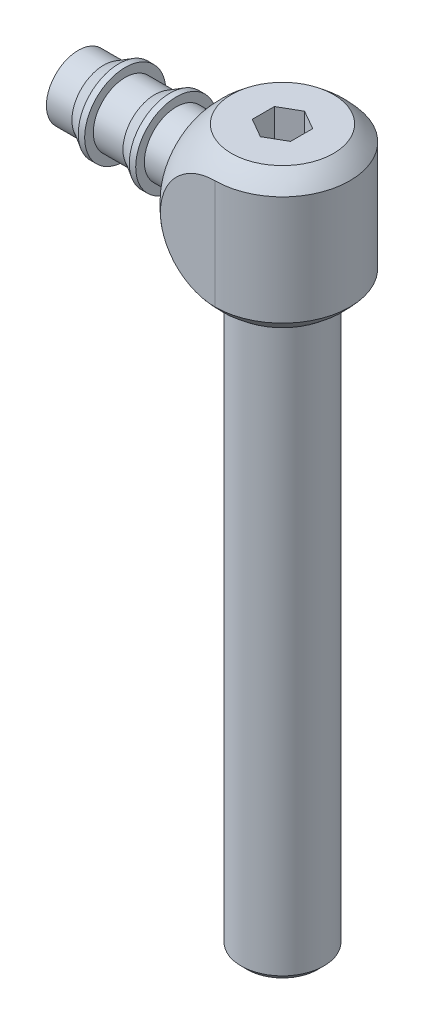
ISO-10303-21;
HEADER;
FILE_DESCRIPTION(('STEP AP214'),'2;1');
FILE_NAME('part.step','',(''),(''),'','','');
FILE_SCHEMA(('AUTOMOTIVE_DESIGN { 1 0 10303 214 1 1 1 1 }'));
ENDSEC;
DATA;
#1=APPLICATION_CONTEXT('core data for automotive mechanical design processes');
#2=APPLICATION_PROTOCOL_DEFINITION('international standard','automotive_design',2000,#1);
#3=PRODUCT_CONTEXT('',#1,'mechanical');
#4=PRODUCT('Part','Part','',(#3));
#5=PRODUCT_RELATED_PRODUCT_CATEGORY('part','',(#4));
#6=PRODUCT_DEFINITION_FORMATION('','',#4);
#7=PRODUCT_DEFINITION_CONTEXT('part definition',#1,'design');
#8=PRODUCT_DEFINITION('design','',#6,#7);
#9=PRODUCT_DEFINITION_SHAPE('','',#8);
#10=(LENGTH_UNIT() NAMED_UNIT(*) SI_UNIT(.MILLI.,.METRE.));
#11=(NAMED_UNIT(*) PLANE_ANGLE_UNIT() SI_UNIT($,.RADIAN.));
#12=(NAMED_UNIT(*) SI_UNIT($,.STERADIAN.) SOLID_ANGLE_UNIT());
#13=UNCERTAINTY_MEASURE_WITH_UNIT(LENGTH_MEASURE(1.E-05),#10,'distance_accuracy_value','');
#14=(GEOMETRIC_REPRESENTATION_CONTEXT(3) GLOBAL_UNCERTAINTY_ASSIGNED_CONTEXT((#13)) GLOBAL_UNIT_ASSIGNED_CONTEXT((#10,
#11,#12)) REPRESENTATION_CONTEXT('',''));
#15=CARTESIAN_POINT('',(0.,0.,0.));
#16=DIRECTION('',(0.,0.,1.));
#17=DIRECTION('',(1.,0.,0.));
#18=AXIS2_PLACEMENT_3D('',#15,#16,#17);
#19=CARTESIAN_POINT('',(-12.7,5.9944,-8.382));
#20=DIRECTION('',(0.,-1.,0.));
#21=DIRECTION('',(0.,0.,-1.));
#22=AXIS2_PLACEMENT_3D('',#19,#20,#21);
#23=PLANE('',#22);
#24=CARTESIAN_POINT('',(0.,5.9944,0.));
#25=DIRECTION('',(0.,-1.,0.));
#26=DIRECTION('',(0.,0.,-1.));
#27=AXIS2_PLACEMENT_3D('',#24,#25,#26);
#28=CIRCLE('',#27,6.34801531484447);
#29=CARTESIAN_POINT('',(0.,5.9944,-6.34801531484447));
#30=VERTEX_POINT('',#29);
#31=EDGE_CURVE('E206',#30,#30,#28,.F.);
#32=ORIENTED_EDGE('',*,*,#31,.F.);
#33=EDGE_LOOP('',(#32));
#34=FACE_BOUND('',#33,.T.);
#35=CARTESIAN_POINT('',(0.,5.9944,0.));
#36=DIRECTION('',(0.,1.,0.));
#37=DIRECTION('',(-1.,0.,0.));
#38=AXIS2_PLACEMENT_3D('',#35,#36,#37);
#39=CIRCLE('',#38,5.1435);
#40=CARTESIAN_POINT('',(-5.1435,5.9944,0.));
#41=VERTEX_POINT('',#40);
#42=EDGE_CURVE('E170',#41,#41,#39,.T.);
#43=ORIENTED_EDGE('',*,*,#42,.T.);
#44=EDGE_LOOP('',(#43));
#45=FACE_BOUND('',#44,.T.);
#46=ADVANCED_FACE('F38',(#34,#45),#23,.T.);
#47=CARTESIAN_POINT('',(-8.382,3.93065,8.382));
#48=DIRECTION('',(1.,0.,0.));
#49=DIRECTION('',(0.,0.,-1.));
#50=AXIS2_PLACEMENT_3D('',#47,#48,#49);
#51=PLANE('',#50);
#52=CARTESIAN_POINT('',(-8.382,14.72565,0.));
#53=DIRECTION('',(1.,0.,0.));
#54=DIRECTION('',(0.,0.,-1.));
#55=AXIS2_PLACEMENT_3D('',#52,#53,#54);
#56=CIRCLE('',#55,4.7625);
#57=CARTESIAN_POINT('',(-8.382,14.72565,-4.7625));
#58=VERTEX_POINT('',#57);
#59=EDGE_CURVE('E12',#58,#58,#56,.T.);
#60=ORIENTED_EDGE('',*,*,#59,.T.);
#61=EDGE_LOOP('',(#60));
#62=FACE_BOUND('',#61,.T.);
#63=CARTESIAN_POINT('',(-8.382,14.72565,0.));
#64=DIRECTION('',(1.,0.,0.));
#65=DIRECTION('',(0.,0.,-1.));
#66=AXIS2_PLACEMENT_3D('',#63,#64,#65);
#67=CIRCLE('',#66,6.80250696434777);
#68=CARTESIAN_POINT('',(-8.382,14.72565,-6.80250696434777));
#69=VERTEX_POINT('',#68);
#70=EDGE_CURVE('E214',#69,#69,#67,.F.);
#71=ORIENTED_EDGE('',*,*,#70,.T.);
#72=EDGE_LOOP('',(#71));
#73=FACE_BOUND('',#72,.T.);
#74=ADVANCED_FACE('F250',(#62,#73),#51,.F.);
#75=CARTESIAN_POINT('',(0.,14.72565,0.));
#76=DIRECTION('',(0.,-1.,0.));
#77=DIRECTION('',(1.,0.,0.));
#78=AXIS2_PLACEMENT_3D('',#75,#76,#77);
#79=SPHERICAL_SURFACE('',#78,10.795);
#80=ORIENTED_EDGE('',*,*,#31,.T.);
#81=EDGE_LOOP('',(#80));
#82=FACE_BOUND('',#81,.T.);
#83=ORIENTED_EDGE('',*,*,#70,.F.);
#84=EDGE_LOOP('',(#83));
#85=FACE_BOUND('',#84,.T.);
#86=CARTESIAN_POINT('',(0.,14.72565,-8.382));
#87=DIRECTION('',(0.,0.,1.));
#88=DIRECTION('',(1.,0.,0.));
#89=AXIS2_PLACEMENT_3D('',#86,#87,#88);
#90=CIRCLE('',#89,6.80250696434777);
#91=CARTESIAN_POINT('',(0.,7.92314303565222,-8.382));
#92=VERTEX_POINT('',#91);
#93=CARTESIAN_POINT('',(0.,21.5281569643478,-8.382));
#94=VERTEX_POINT('',#93);
#95=EDGE_CURVE('E222',#92,#94,#90,.F.);
#96=ORIENTED_EDGE('',*,*,#95,.F.);
#97=CARTESIAN_POINT('',(0.,7.92314303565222,0.));
#98=DIRECTION('',(0.,1.,0.));
#99=DIRECTION('',(0.,0.,1.));
#100=AXIS2_PLACEMENT_3D('',#97,#98,#99);
#101=CIRCLE('',#100,8.382);
#102=CARTESIAN_POINT('',(0.,7.92314303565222,8.382));
#103=VERTEX_POINT('',#102);
#104=EDGE_CURVE('E220',#103,#92,#101,.T.);
#105=ORIENTED_EDGE('',*,*,#104,.F.);
#106=CARTESIAN_POINT('',(0.,14.72565,8.382));
#107=DIRECTION('',(0.,0.,-1.));
#108=DIRECTION('',(-1.,0.,0.));
#109=AXIS2_PLACEMENT_3D('',#106,#107,#108);
#110=CIRCLE('',#109,6.80250696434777);
#111=CARTESIAN_POINT('',(0.,21.5281569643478,8.382));
#112=VERTEX_POINT('',#111);
#113=EDGE_CURVE('E215',#112,#103,#110,.F.);
#114=ORIENTED_EDGE('',*,*,#113,.F.);
#115=CARTESIAN_POINT('',(0.,21.5281569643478,0.));
#116=DIRECTION('',(0.,-1.,0.));
#117=DIRECTION('',(0.,0.,-1.));
#118=AXIS2_PLACEMENT_3D('',#115,#116,#117);
#119=CIRCLE('',#118,8.382);
#120=EDGE_CURVE('E217',#94,#112,#119,.T.);
#121=ORIENTED_EDGE('',*,*,#120,.F.);
#122=EDGE_LOOP('',(#96,#105,#114,#121));
#123=FACE_BOUND('',#122,.T.);
#124=CARTESIAN_POINT('',(0.,23.4569,0.));
#125=DIRECTION('',(0.,1.,0.));
#126=DIRECTION('',(0.,0.,1.));
#127=AXIS2_PLACEMENT_3D('',#124,#125,#126);
#128=CIRCLE('',#127,6.34801531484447);
#129=CARTESIAN_POINT('',(0.,23.4569,6.34801531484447));
#130=VERTEX_POINT('',#129);
#131=EDGE_CURVE('E211',#130,#130,#128,.F.);
#132=ORIENTED_EDGE('',*,*,#131,.T.);
#133=EDGE_LOOP('',(#132));
#134=FACE_BOUND('',#133,.T.);
#135=ADVANCED_FACE('F256',(#82,#85,#123,#134),#79,.T.);
#136=CARTESIAN_POINT('',(0.,3.93065,-8.382));
#137=DIRECTION('',(0.,0.,1.));
#138=DIRECTION('',(1.,0.,0.));
#139=AXIS2_PLACEMENT_3D('',#136,#137,#138);
#140=PLANE('',#139);
#141=ORIENTED_EDGE('',*,*,#95,.T.);
#142=DIRECTION('',(0.,-1.,0.));
#143=VECTOR('',#142,1.);
#144=CARTESIAN_POINT('',(0.,3.93065,-8.382));
#145=LINE('',#144,#143);
#146=EDGE_CURVE('E210',#94,#92,#145,.T.);
#147=ORIENTED_EDGE('',*,*,#146,.T.);
#148=EDGE_LOOP('',(#141,#147));
#149=FACE_BOUND('',#148,.T.);
#150=ADVANCED_FACE('F268',(#149),#140,.F.);
#151=CARTESIAN_POINT('',(0.,3.93065,8.382));
#152=DIRECTION('',(0.,0.,-1.));
#153=DIRECTION('',(-1.,0.,0.));
#154=AXIS2_PLACEMENT_3D('',#151,#152,#153);
#155=PLANE('',#154);
#156=ORIENTED_EDGE('',*,*,#113,.T.);
#157=DIRECTION('',(0.,-1.,0.));
#158=VECTOR('',#157,1.);
#159=CARTESIAN_POINT('',(0.,3.93065,8.382));
#160=LINE('',#159,#158);
#161=EDGE_CURVE('E207',#112,#103,#160,.T.);
#162=ORIENTED_EDGE('',*,*,#161,.F.);
#163=EDGE_LOOP('',(#156,#162));
#164=FACE_BOUND('',#163,.T.);
#165=ADVANCED_FACE('F265',(#164),#155,.F.);
#166=CARTESIAN_POINT('',(0.,3.93065,0.));
#167=DIRECTION('',(0.,-1.,0.));
#168=DIRECTION('',(0.,0.,-1.));
#169=AXIS2_PLACEMENT_3D('',#166,#167,#168);
#170=CYLINDRICAL_SURFACE('',#169,8.382);
#171=ORIENTED_EDGE('',*,*,#104,.T.);
#172=ORIENTED_EDGE('',*,*,#146,.F.);
#173=ORIENTED_EDGE('',*,*,#120,.T.);
#174=ORIENTED_EDGE('',*,*,#161,.T.);
#175=EDGE_LOOP('',(#171,#172,#173,#174));
#176=FACE_BOUND('',#175,.T.);
#177=ADVANCED_FACE('F267',(#176),#170,.T.);
#178=CARTESIAN_POINT('',(-12.7,23.4569,-8.382));
#179=DIRECTION('',(0.,1.,0.));
#180=DIRECTION('',(0.,0.,1.));
#181=AXIS2_PLACEMENT_3D('',#178,#179,#180);
#182=PLANE('',#181);
#183=DIRECTION('',(0.866025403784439,0.,0.5));
#184=VECTOR('',#183,1.);
#185=CARTESIAN_POINT('',(-2.38125,23.4569,1.3748153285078));
#186=LINE('',#185,#184);
#187=CARTESIAN_POINT('',(-2.38125,23.4569,1.3748153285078));
#188=VERTEX_POINT('',#187);
#189=CARTESIAN_POINT('',(0.,23.4569,2.74963065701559));
#190=VERTEX_POINT('',#189);
#191=EDGE_CURVE('E59',#188,#190,#186,.T.);
#192=ORIENTED_EDGE('',*,*,#191,.F.);
#193=DIRECTION('',(0.,0.,1.));
#194=VECTOR('',#193,1.);
#195=CARTESIAN_POINT('',(-2.38125,23.4569,-1.3748153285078));
#196=LINE('',#195,#194);
#197=CARTESIAN_POINT('',(-2.38125,23.4569,-1.3748153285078));
#198=VERTEX_POINT('',#197);
#199=EDGE_CURVE('E127',#198,#188,#196,.T.);
#200=ORIENTED_EDGE('',*,*,#199,.F.);
#201=DIRECTION('',(-0.866025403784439,0.,0.5));
#202=VECTOR('',#201,1.);
#203=CARTESIAN_POINT('',(0.,23.4569,-2.74963065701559));
#204=LINE('',#203,#202);
#205=CARTESIAN_POINT('',(0.,23.4569,-2.74963065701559));
#206=VERTEX_POINT('',#205);
#207=EDGE_CURVE('E130',#206,#198,#204,.T.);
#208=ORIENTED_EDGE('',*,*,#207,.F.);
#209=DIRECTION('',(-0.866025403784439,0.,-0.5));
#210=VECTOR('',#209,1.);
#211=CARTESIAN_POINT('',(2.38125,23.4569,-1.3748153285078));
#212=LINE('',#211,#210);
#213=CARTESIAN_POINT('',(2.38125,23.4569,-1.3748153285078));
#214=VERTEX_POINT('',#213);
#215=EDGE_CURVE('E153',#214,#206,#212,.T.);
#216=ORIENTED_EDGE('',*,*,#215,.F.);
#217=DIRECTION('',(0.,0.,-1.));
#218=VECTOR('',#217,1.);
#219=CARTESIAN_POINT('',(2.38125,23.4569,1.3748153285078));
#220=LINE('',#219,#218);
#221=CARTESIAN_POINT('',(2.38125,23.4569,1.3748153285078));
#222=VERTEX_POINT('',#221);
#223=EDGE_CURVE('E150',#222,#214,#220,.T.);
#224=ORIENTED_EDGE('',*,*,#223,.F.);
#225=DIRECTION('',(0.866025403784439,0.,-0.5));
#226=VECTOR('',#225,1.);
#227=CARTESIAN_POINT('',(0.,23.4569,2.74963065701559));
#228=LINE('',#227,#226);
#229=EDGE_CURVE('E148',#190,#222,#228,.T.);
#230=ORIENTED_EDGE('',*,*,#229,.F.);
#231=EDGE_LOOP('',(#192,#200,#208,#216,#224,#230));
#232=FACE_BOUND('',#231,.T.);
#233=ORIENTED_EDGE('',*,*,#131,.F.);
#234=EDGE_LOOP('',(#233));
#235=FACE_BOUND('',#234,.T.);
#236=ADVANCED_FACE('F263',(#232,#235),#182,.T.);
#237=CARTESIAN_POINT('',(0.,14.72565,0.));
#238=DIRECTION('',(-1.,0.,0.));
#239=DIRECTION('',(0.,0.,1.));
#240=AXIS2_PLACEMENT_3D('',#237,#238,#239);
#241=CYLINDRICAL_SURFACE('',#240,3.96875);
#242=CARTESIAN_POINT('',(-9.17575,14.72565,0.));
#243=DIRECTION('',(1.,0.,0.));
#244=DIRECTION('',(0.,0.,-1.));
#245=AXIS2_PLACEMENT_3D('',#242,#243,#244);
#246=CIRCLE('',#245,3.96875);
#247=CARTESIAN_POINT('',(-9.17575,14.72565,-3.96875));
#248=VERTEX_POINT('',#247);
#249=EDGE_CURVE('E46',#248,#248,#246,.F.);
#250=ORIENTED_EDGE('',*,*,#249,.T.);
#251=EDGE_LOOP('',(#250));
#252=FACE_BOUND('',#251,.T.);
#253=CARTESIAN_POINT('',(-13.2115011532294,14.72565,0.));
#254=DIRECTION('',(-1.,0.,0.));
#255=DIRECTION('',(0.,0.,1.));
#256=AXIS2_PLACEMENT_3D('',#253,#254,#255);
#257=CIRCLE('',#256,3.96875);
#258=CARTESIAN_POINT('',(-13.2115011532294,14.72565,3.96875));
#259=VERTEX_POINT('',#258);
#260=EDGE_CURVE('E182',#259,#259,#257,.T.);
#261=ORIENTED_EDGE('',*,*,#260,.F.);
#262=EDGE_LOOP('',(#261));
#263=FACE_BOUND('',#262,.T.);
#264=ADVANCED_FACE('F232',(#252,#263),#241,.T.);
#265=CARTESIAN_POINT('',(0.,14.72565,0.));
#266=DIRECTION('',(-1.,0.,0.));
#267=DIRECTION('',(0.,0.,1.));
#268=AXIS2_PLACEMENT_3D('',#265,#266,#267);
#269=CYLINDRICAL_SURFACE('',#268,3.96875);
#270=CARTESIAN_POINT('',(-25.4,14.72565,0.));
#271=DIRECTION('',(-1.,0.,0.));
#272=DIRECTION('',(0.,0.,1.));
#273=AXIS2_PLACEMENT_3D('',#270,#271,#272);
#274=CIRCLE('',#273,3.96875);
#275=CARTESIAN_POINT('',(-25.4,14.72565,3.96875));
#276=VERTEX_POINT('',#275);
#277=EDGE_CURVE('E179',#276,#276,#274,.T.);
#278=ORIENTED_EDGE('',*,*,#277,.F.);
#279=EDGE_LOOP('',(#278));
#280=FACE_BOUND('',#279,.T.);
#281=CARTESIAN_POINT('',(-22.225,14.72565,0.));
#282=DIRECTION('',(-1.,0.,0.));
#283=DIRECTION('',(0.,0.,1.));
#284=AXIS2_PLACEMENT_3D('',#281,#282,#283);
#285=CIRCLE('',#284,3.96875);
#286=CARTESIAN_POINT('',(-22.225,14.72565,3.96875));
#287=VERTEX_POINT('',#286);
#288=EDGE_CURVE('E203',#287,#287,#285,.T.);
#289=ORIENTED_EDGE('',*,*,#288,.T.);
#290=EDGE_LOOP('',(#289));
#291=FACE_BOUND('',#290,.T.);
#292=ADVANCED_FACE('F294',(#280,#291),#269,.T.);
#293=CARTESIAN_POINT('',(-20.3552511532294,14.72565,0.));
#294=DIRECTION('',(1.,0.,0.));
#295=DIRECTION('',(0.,0.,-1.));
#296=AXIS2_PLACEMENT_3D('',#293,#294,#295);
#297=CONICAL_SURFACE('',#296,5.04825,0.523598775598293);
#298=ORIENTED_EDGE('',*,*,#288,.F.);
#299=EDGE_LOOP('',(#298));
#300=FACE_BOUND('',#299,.T.);
#301=CARTESIAN_POINT('',(-20.3552511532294,14.72565,0.));
#302=DIRECTION('',(-1.,0.,0.));
#303=DIRECTION('',(0.,0.,1.));
#304=AXIS2_PLACEMENT_3D('',#301,#302,#303);
#305=CIRCLE('',#304,5.04825);
#306=CARTESIAN_POINT('',(-20.3552511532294,14.72565,5.04825));
#307=VERTEX_POINT('',#306);
#308=EDGE_CURVE('E200',#307,#307,#305,.T.);
#309=ORIENTED_EDGE('',*,*,#308,.T.);
#310=EDGE_LOOP('',(#309));
#311=FACE_BOUND('',#310,.T.);
#312=ADVANCED_FACE('F360',(#300,#311),#297,.T.);
#313=CARTESIAN_POINT('',(0.,14.72565,0.));
#314=DIRECTION('',(-1.,0.,0.));
#315=DIRECTION('',(0.,0.,1.));
#316=AXIS2_PLACEMENT_3D('',#313,#314,#315);
#317=CYLINDRICAL_SURFACE('',#316,5.04825);
#318=ORIENTED_EDGE('',*,*,#308,.F.);
#319=EDGE_LOOP('',(#318));
#320=FACE_BOUND('',#319,.T.);
#321=CARTESIAN_POINT('',(-19.5615011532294,14.72565,0.));
#322=DIRECTION('',(-1.,0.,0.));
#323=DIRECTION('',(0.,0.,1.));
#324=AXIS2_PLACEMENT_3D('',#321,#322,#323);
#325=CIRCLE('',#324,5.04825);
#326=CARTESIAN_POINT('',(-19.5615011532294,14.72565,5.04825));
#327=VERTEX_POINT('',#326);
#328=EDGE_CURVE('E197',#327,#327,#325,.T.);
#329=ORIENTED_EDGE('',*,*,#328,.T.);
#330=EDGE_LOOP('',(#329));
#331=FACE_BOUND('',#330,.T.);
#332=ADVANCED_FACE('F356',(#320,#331),#317,.T.);
#333=CARTESIAN_POINT('',(-19.5615011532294,14.72565,-5.04825));
#334=DIRECTION('',(-1.,0.,0.));
#335=DIRECTION('',(0.,0.,1.));
#336=AXIS2_PLACEMENT_3D('',#333,#334,#335);
#337=PLANE('',#336);
#338=ORIENTED_EDGE('',*,*,#328,.F.);
#339=EDGE_LOOP('',(#338));
#340=FACE_BOUND('',#339,.T.);
#341=CARTESIAN_POINT('',(-19.5615011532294,14.72565,0.));
#342=DIRECTION('',(-1.,0.,0.));
#343=DIRECTION('',(0.,0.,1.));
#344=AXIS2_PLACEMENT_3D('',#341,#342,#343);
#345=CIRCLE('',#344,3.96875);
#346=CARTESIAN_POINT('',(-19.5615011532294,14.72565,3.96875));
#347=VERTEX_POINT('',#346);
#348=EDGE_CURVE('E194',#347,#347,#345,.T.);
#349=ORIENTED_EDGE('',*,*,#348,.T.);
#350=EDGE_LOOP('',(#349));
#351=FACE_BOUND('',#350,.T.);
#352=ADVANCED_FACE('F352',(#340,#351),#337,.F.);
#353=CARTESIAN_POINT('',(0.,14.72565,0.));
#354=DIRECTION('',(-1.,0.,0.));
#355=DIRECTION('',(0.,0.,1.));
#356=AXIS2_PLACEMENT_3D('',#353,#354,#355);
#357=CYLINDRICAL_SURFACE('',#356,3.96875);
#358=ORIENTED_EDGE('',*,*,#348,.F.);
#359=EDGE_LOOP('',(#358));
#360=FACE_BOUND('',#359,.T.);
#361=CARTESIAN_POINT('',(-15.875,14.72565,0.));
#362=DIRECTION('',(-1.,0.,0.));
#363=DIRECTION('',(0.,0.,1.));
#364=AXIS2_PLACEMENT_3D('',#361,#362,#363);
#365=CIRCLE('',#364,3.96875);
#366=CARTESIAN_POINT('',(-15.875,14.72565,3.96875));
#367=VERTEX_POINT('',#366);
#368=EDGE_CURVE('E191',#367,#367,#365,.T.);
#369=ORIENTED_EDGE('',*,*,#368,.T.);
#370=EDGE_LOOP('',(#369));
#371=FACE_BOUND('',#370,.T.);
#372=ADVANCED_FACE('F348',(#360,#371),#357,.T.);
#373=CARTESIAN_POINT('',(-14.0052511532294,14.72565,0.));
#374=DIRECTION('',(1.,0.,0.));
#375=DIRECTION('',(0.,0.,-1.));
#376=AXIS2_PLACEMENT_3D('',#373,#374,#375);
#377=CONICAL_SURFACE('',#376,5.04825,0.523598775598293);
#378=ORIENTED_EDGE('',*,*,#368,.F.);
#379=EDGE_LOOP('',(#378));
#380=FACE_BOUND('',#379,.T.);
#381=CARTESIAN_POINT('',(-14.0052511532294,14.72565,0.));
#382=DIRECTION('',(-1.,0.,0.));
#383=DIRECTION('',(0.,0.,1.));
#384=AXIS2_PLACEMENT_3D('',#381,#382,#383);
#385=CIRCLE('',#384,5.04825);
#386=CARTESIAN_POINT('',(-14.0052511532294,14.72565,5.04825));
#387=VERTEX_POINT('',#386);
#388=EDGE_CURVE('E188',#387,#387,#385,.T.);
#389=ORIENTED_EDGE('',*,*,#388,.T.);
#390=EDGE_LOOP('',(#389));
#391=FACE_BOUND('',#390,.T.);
#392=ADVANCED_FACE('F344',(#380,#391),#377,.T.);
#393=CARTESIAN_POINT('',(0.,14.72565,0.));
#394=DIRECTION('',(-1.,0.,0.));
#395=DIRECTION('',(0.,0.,1.));
#396=AXIS2_PLACEMENT_3D('',#393,#394,#395);
#397=CYLINDRICAL_SURFACE('',#396,5.04825);
#398=ORIENTED_EDGE('',*,*,#388,.F.);
#399=EDGE_LOOP('',(#398));
#400=FACE_BOUND('',#399,.T.);
#401=CARTESIAN_POINT('',(-13.2115011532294,14.72565,0.));
#402=DIRECTION('',(-1.,0.,0.));
#403=DIRECTION('',(0.,0.,1.));
#404=AXIS2_PLACEMENT_3D('',#401,#402,#403);
#405=CIRCLE('',#404,5.04825);
#406=CARTESIAN_POINT('',(-13.2115011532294,14.72565,5.04825));
#407=VERTEX_POINT('',#406);
#408=EDGE_CURVE('E185',#407,#407,#405,.T.);
#409=ORIENTED_EDGE('',*,*,#408,.T.);
#410=EDGE_LOOP('',(#409));
#411=FACE_BOUND('',#410,.T.);
#412=ADVANCED_FACE('F340',(#400,#411),#397,.T.);
#413=CARTESIAN_POINT('',(-13.2115011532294,14.72565,-5.04825));
#414=DIRECTION('',(-1.,0.,0.));
#415=DIRECTION('',(0.,0.,1.));
#416=AXIS2_PLACEMENT_3D('',#413,#414,#415);
#417=PLANE('',#416);
#418=ORIENTED_EDGE('',*,*,#408,.F.);
#419=EDGE_LOOP('',(#418));
#420=FACE_BOUND('',#419,.T.);
#421=ORIENTED_EDGE('',*,*,#260,.T.);
#422=EDGE_LOOP('',(#421));
#423=FACE_BOUND('',#422,.T.);
#424=ADVANCED_FACE('F245',(#420,#423),#417,.F.);
#425=CARTESIAN_POINT('',(-25.4,14.72565,0.));
#426=DIRECTION('',(1.,0.,0.));
#427=DIRECTION('',(0.,0.,-1.));
#428=AXIS2_PLACEMENT_3D('',#425,#426,#427);
#429=PLANE('',#428);
#430=CARTESIAN_POINT('',(-25.4,14.72565,0.));
#431=DIRECTION('',(-1.,0.,0.));
#432=DIRECTION('',(0.,0.,1.));
#433=AXIS2_PLACEMENT_3D('',#430,#431,#432);
#434=CIRCLE('',#433,2.69875);
#435=CARTESIAN_POINT('',(-25.4,14.72565,2.69875));
#436=VERTEX_POINT('',#435);
#437=EDGE_CURVE('E176',#436,#436,#434,.T.);
#438=ORIENTED_EDGE('',*,*,#437,.F.);
#439=EDGE_LOOP('',(#438));
#440=FACE_BOUND('',#439,.T.);
#441=ORIENTED_EDGE('',*,*,#277,.T.);
#442=EDGE_LOOP('',(#441));
#443=FACE_BOUND('',#442,.T.);
#444=ADVANCED_FACE('F237',(#440,#443),#429,.F.);
#445=CARTESIAN_POINT('',(-9.17575,14.72565,0.));
#446=DIRECTION('',(1.,0.,0.));
#447=DIRECTION('',(0.,0.,-1.));
#448=AXIS2_PLACEMENT_3D('',#445,#446,#447);
#449=TOROIDAL_SURFACE('',#448,4.7625,0.79375);
#450=ORIENTED_EDGE('',*,*,#59,.F.);
#451=EDGE_LOOP('',(#450));
#452=FACE_BOUND('',#451,.T.);
#453=ORIENTED_EDGE('',*,*,#249,.F.);
#454=EDGE_LOOP('',(#453));
#455=FACE_BOUND('',#454,.T.);
#456=ADVANCED_FACE('F40',(#452,#455),#449,.F.);
#457=CARTESIAN_POINT('',(7.63321770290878,14.72565,0.));
#458=DIRECTION('',(-1.,0.,0.));
#459=DIRECTION('',(0.,0.,1.));
#460=AXIS2_PLACEMENT_3D('',#457,#458,#459);
#461=CYLINDRICAL_SURFACE('',#460,2.69875);
#462=CARTESIAN_POINT('',(-1.67253503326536,14.72565,2.69875));
#463=CARTESIAN_POINT('',(-1.67255211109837,14.6336040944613,2.69874379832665));
#464=CARTESIAN_POINT('',(-1.68030737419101,14.5413935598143,2.69397876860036));
#465=CARTESIAN_POINT('',(-1.70965334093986,14.3600513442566,2.6754407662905));
#466=CARTESIAN_POINT('',(-1.73129393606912,14.2709319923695,2.6616353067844));
#467=CARTESIAN_POINT('',(-1.79559166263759,14.0620653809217,2.61886906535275));
#468=CARTESIAN_POINT('',(-1.84322459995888,13.9447005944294,2.58601902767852));
#469=CARTESIAN_POINT('',(-1.94924432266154,13.7196111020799,2.50708214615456));
#470=CARTESIAN_POINT('',(-2.00766742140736,13.611920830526,2.46095030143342));
#471=CARTESIAN_POINT('',(-2.11389977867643,13.4314134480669,2.36974043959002));
#472=CARTESIAN_POINT('',(-2.1606894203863,13.3566308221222,2.32730777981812));
#473=CARTESIAN_POINT('',(-2.25521327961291,13.2118402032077,2.23583843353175));
#474=CARTESIAN_POINT('',(-2.30294793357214,13.1418344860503,2.18679863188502));
#475=CARTESIAN_POINT('',(-2.44537137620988,12.9390900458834,2.02993736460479));
#476=CARTESIAN_POINT('',(-2.53948214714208,12.8133013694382,1.91221018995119));
#477=CARTESIAN_POINT('',(-2.69741005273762,12.6086236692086,1.67925509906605));
#478=CARTESIAN_POINT('',(-2.76334225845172,12.5255007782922,1.56915117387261));
#479=CARTESIAN_POINT('',(-2.8845069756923,12.3751171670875,1.33331317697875));
#480=CARTESIAN_POINT('',(-2.93975714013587,12.307830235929,1.20760546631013));
#481=CARTESIAN_POINT('',(-3.02669761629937,12.2029104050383,0.965996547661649));
#482=CARTESIAN_POINT('',(-3.06083309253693,12.1621279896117,0.852351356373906));
#483=CARTESIAN_POINT('',(-3.1166489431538,12.0957347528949,0.617756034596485));
#484=CARTESIAN_POINT('',(-3.13833661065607,12.0701150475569,0.496810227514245));
#485=CARTESIAN_POINT('',(-3.16756477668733,12.0356355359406,0.250255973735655));
#486=CARTESIAN_POINT('',(-3.17504030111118,12.0268527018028,0.124628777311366));
#487=CARTESIAN_POINT('',(-3.17495938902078,12.0269476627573,-0.126612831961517));
#488=CARTESIAN_POINT('',(-3.16740418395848,12.0358240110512,-0.252227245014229));
#489=CARTESIAN_POINT('',(-3.13906073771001,12.0692617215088,-0.490120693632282));
#490=CARTESIAN_POINT('',(-3.11929320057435,12.0926136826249,-0.60269865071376));
#491=CARTESIAN_POINT('',(-3.06889165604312,12.1525228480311,-0.821684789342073));
#492=CARTESIAN_POINT('',(-3.0382559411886,12.1890821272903,-0.928091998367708));
#493=CARTESIAN_POINT('',(-2.96516187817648,12.2770863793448,-1.14109828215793));
#494=CARTESIAN_POINT('',(-2.92195926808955,12.3294810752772,-1.24704491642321));
#495=CARTESIAN_POINT('',(-2.82749393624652,12.4456326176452,-1.44856037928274));
#496=CARTESIAN_POINT('',(-2.7762249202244,12.509398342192,-1.54412100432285));
#497=CARTESIAN_POINT('',(-2.64107061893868,12.6806705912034,-1.76919838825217));
#498=CARTESIAN_POINT('',(-2.55361488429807,12.7941913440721,-1.89206722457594));
#499=CARTESIAN_POINT('',(-2.41868897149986,12.9779675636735,-2.05808234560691));
#500=CARTESIAN_POINT('',(-2.37301515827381,13.0415862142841,-2.11044056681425));
#501=CARTESIAN_POINT('',(-2.28147308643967,13.1732393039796,-2.20907783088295));
#502=CARTESIAN_POINT('',(-2.2356048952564,13.2412723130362,-2.25535882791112));
#503=CARTESIAN_POINT('',(-2.1202809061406,13.4198391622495,-2.36523523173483));
#504=CARTESIAN_POINT('',(-2.05150591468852,13.5334337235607,-2.42463084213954));
#505=CARTESIAN_POINT('',(-1.92271094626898,13.7719618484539,-2.52795441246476));
#506=CARTESIAN_POINT('',(-1.86266516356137,13.8968601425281,-2.57192853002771));
#507=CARTESIAN_POINT('',(-1.78077698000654,14.1096800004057,-2.62887122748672));
#508=CARTESIAN_POINT('',(-1.75306179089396,14.1938255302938,-2.64728021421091));
#509=CARTESIAN_POINT('',(-1.70870062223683,14.3662363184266,-2.67613043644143));
#510=CARTESIAN_POINT('',(-1.69202667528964,14.4544905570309,-2.68659181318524));
#511=CARTESIAN_POINT('',(-1.67265387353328,14.6340682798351,-2.69870532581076));
#512=CARTESIAN_POINT('',(-1.67008779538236,14.7254128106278,-2.70027376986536));
#513=CARTESIAN_POINT('',(-1.67988247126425,14.9070145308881,-2.69418627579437));
#514=CARTESIAN_POINT('',(-1.6922589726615,14.9972704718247,-2.68652060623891));
#515=CARTESIAN_POINT('',(-1.7331500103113,15.191766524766,-2.66035549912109));
#516=CARTESIAN_POINT('',(-1.76442210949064,15.2951431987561,-2.63997856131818));
#517=CARTESIAN_POINT('',(-1.83863516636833,15.4950102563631,-2.58883374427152));
#518=CARTESIAN_POINT('',(-1.88161671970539,15.5914751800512,-2.55802962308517));
#519=CARTESIAN_POINT('',(-1.96594760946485,15.7610019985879,-2.49358880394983));
#520=CARTESIAN_POINT('',(-2.00623298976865,15.8351790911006,-2.46142489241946));
#521=CARTESIAN_POINT('',(-2.08936635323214,15.979262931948,-2.39126158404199));
#522=CARTESIAN_POINT('',(-2.13221586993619,16.0491670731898,-2.35325867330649));
#523=CARTESIAN_POINT('',(-2.21905453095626,16.1849481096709,-2.27155980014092));
#524=CARTESIAN_POINT('',(-2.26304496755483,16.2508201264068,-2.22785713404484));
#525=CARTESIAN_POINT('',(-2.35099285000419,16.3785061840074,-2.13484329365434));
#526=CARTESIAN_POINT('',(-2.39495029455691,16.4403200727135,-2.08553190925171));
#527=CARTESIAN_POINT('',(-2.48370497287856,16.5622876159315,-1.979099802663));
#528=CARTESIAN_POINT('',(-2.52845989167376,16.6222623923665,-1.92173801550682));
#529=CARTESIAN_POINT('',(-2.61591794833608,16.7373786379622,-1.80087889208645));
#530=CARTESIAN_POINT('',(-2.65862069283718,16.7925191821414,-1.73738038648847));
#531=CARTESIAN_POINT('',(-2.74088519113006,16.8973147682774,-1.60445089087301));
#532=CARTESIAN_POINT('',(-2.78045536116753,16.9469846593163,-1.53503691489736));
#533=CARTESIAN_POINT('',(-2.85559156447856,17.0403412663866,-1.39027931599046));
#534=CARTESIAN_POINT('',(-2.89115808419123,17.0840287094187,-1.31493641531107));
#535=CARTESIAN_POINT('',(-2.96948570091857,17.1795188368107,-1.12971481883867));
#536=CARTESIAN_POINT('',(-3.01006724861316,17.2283781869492,-1.01734187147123));
#537=CARTESIAN_POINT('',(-3.07916183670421,17.3110665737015,-0.783710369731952));
#538=CARTESIAN_POINT('',(-3.10768386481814,17.3449068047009,-0.662458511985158));
#539=CARTESIAN_POINT('',(-3.1505580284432,17.3956367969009,-0.413138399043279));
#540=CARTESIAN_POINT('',(-3.16482128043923,17.4124202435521,-0.285032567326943));
#541=CARTESIAN_POINT('',(-3.17750938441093,17.4273549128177,-0.0269638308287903));
#542=CARTESIAN_POINT('',(-3.17593964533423,17.4255124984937,0.102998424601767));
#543=CARTESIAN_POINT('',(-3.15805196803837,17.4044450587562,0.347774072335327));
#544=CARTESIAN_POINT('',(-3.14316138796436,17.3869022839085,0.462845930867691));
#545=CARTESIAN_POINT('',(-3.10172582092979,17.3378332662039,0.687755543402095));
#546=CARTESIAN_POINT('',(-3.07517832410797,17.3063040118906,0.797592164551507));
#547=CARTESIAN_POINT('',(-3.01075529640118,17.2291965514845,1.0145713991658));
#548=CARTESIAN_POINT('',(-2.972428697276,17.183056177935,1.12137726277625));
#549=CARTESIAN_POINT('',(-2.88722384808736,17.0792763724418,1.32545171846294));
#550=CARTESIAN_POINT('',(-2.84034344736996,17.0216340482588,1.42271790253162));
#551=CARTESIAN_POINT('',(-2.71605399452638,16.8663791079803,1.65160595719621));
#552=CARTESIAN_POINT('',(-2.63481467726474,16.7628851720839,1.77721796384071));
#553=CARTESIAN_POINT('',(-2.50765715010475,16.5944236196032,1.94869400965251));
#554=CARTESIAN_POINT('',(-2.46427045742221,16.535899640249,2.00314635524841));
#555=CARTESIAN_POINT('',(-2.37662732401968,16.4146570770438,2.10638022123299));
#556=CARTESIAN_POINT('',(-2.33237124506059,16.3519402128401,2.15516404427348));
#557=CARTESIAN_POINT('',(-2.24309983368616,16.2211289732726,2.24796735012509));
#558=CARTESIAN_POINT('',(-2.19808683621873,16.1529526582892,2.29187325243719));
#559=CARTESIAN_POINT('',(-2.10940838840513,16.0122046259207,2.37374405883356));
#560=CARTESIAN_POINT('',(-2.06574372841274,15.939630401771,2.41170552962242));
#561=CARTESIAN_POINT('',(-1.98162010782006,15.7901911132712,2.48128395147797));
#562=CARTESIAN_POINT('',(-1.94114788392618,15.7133463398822,2.51292809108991));
#563=CARTESIAN_POINT('',(-1.86549790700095,15.554835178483,2.56958583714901));
#564=CARTESIAN_POINT('',(-1.83031224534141,15.4731762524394,2.59460939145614));
#565=CARTESIAN_POINT('',(-1.76840670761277,15.3052577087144,2.63718971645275));
#566=CARTESIAN_POINT('',(-1.74164334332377,15.2190245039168,2.65478500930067));
#567=CARTESIAN_POINT('',(-1.70017397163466,15.0425924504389,2.68154268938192));
#568=CARTESIAN_POINT('',(-1.68541613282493,14.9524124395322,2.69074134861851));
#569=CARTESIAN_POINT('',(-1.67621364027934,14.8389420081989,2.69646684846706));
#570=CARTESIAN_POINT('',(-1.67483830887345,14.8163192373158,2.69732149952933));
#571=CARTESIAN_POINT('',(-1.67299678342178,14.7710176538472,2.69846391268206));
#572=CARTESIAN_POINT('',(-1.67253082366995,14.7483388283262,2.69875152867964));
#573=CARTESIAN_POINT('',(-1.67253503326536,14.72565,2.69875));
#574=B_SPLINE_CURVE_WITH_KNOTS('',3,(#462,#463,#464,#465,#466,#467,#468,#469,#470,#471,#472,
#473,#474,#475,#476,#477,#478,#479,#480,#481,#482,#483,#484,#485,#486,#487,#488,#489,#490,#491,
#492,#493,#494,#495,#496,#497,#498,#499,#500,#501,#502,#503,#504,#505,#506,#507,#508,#509,#510,
#511,#512,#513,#514,#515,#516,#517,#518,#519,#520,#521,#522,#523,#524,#525,#526,#527,#528,#529,
#530,#531,#532,#533,#534,#535,#536,#537,#538,#539,#540,#541,#542,#543,#544,#545,#546,#547,#548,
#549,#550,#551,#552,#553,#554,#555,#556,#557,#558,#559,#560,#561,#562,#563,#564,#565,#566,#567,
#568,#569,#570,#571,#572,#573),.UNSPECIFIED.,.T.,.F.,(4,2,2,2,2,2,2,2,2,2,2,2,2,2,2,2,2,2,2,2,2,
2,2,2,2,2,2,2,2,2,2,2,2,2,2,2,2,2,2,2,2,2,2,2,2,2,2,2,2,2,2,2,2,2,2,4),(0.,0.276033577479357,
0.553064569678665,0.943409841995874,1.33509355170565,1.62840237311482,1.92184997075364,
2.50751524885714,2.96462159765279,3.4209659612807,3.79583793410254,4.17049004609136,
4.54685088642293,4.92318089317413,5.27166019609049,5.62019427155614,5.99633605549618,
6.37277281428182,6.935802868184,7.21820755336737,7.50052120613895,7.93575012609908,
8.36966502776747,8.64026299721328,8.91017289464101,9.18261876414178,9.4553520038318,
9.78324326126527,10.1122860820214,10.3829361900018,10.6537498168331,10.9248848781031,
11.1960300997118,11.478567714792,11.761159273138,12.042963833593,12.3247341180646,
12.7103529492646,13.0956838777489,13.4834021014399,13.8709878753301,14.2214410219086,
14.5719696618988,14.9380788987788,15.3042803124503,15.846818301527,16.1194850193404,
16.3920405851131,16.6699976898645,16.9481147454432,17.2250077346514,17.5014822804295,
17.7765049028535,18.0503337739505,18.1183570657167,18.1863978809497),.UNSPECIFIED.);
#575=CARTESIAN_POINT('',(-3.175,17.4244,0.));
#576=VERTEX_POINT('',#575);
#577=EDGE_CURVE('E133',#576,#576,#574,.T.);
#578=ORIENTED_EDGE('',*,*,#577,.T.);
#579=EDGE_LOOP('',(#578));
#580=FACE_BOUND('',#579,.T.);
#581=ORIENTED_EDGE('',*,*,#437,.T.);
#582=EDGE_LOOP('',(#581));
#583=FACE_BOUND('',#582,.T.);
#584=ADVANCED_FACE('F236',(#580,#583),#461,.F.);
#585=CARTESIAN_POINT('',(0.,-65.4431,0.));
#586=DIRECTION('',(0.,1.,0.));
#587=DIRECTION('',(-1.,0.,0.));
#588=AXIS2_PLACEMENT_3D('',#585,#586,#587);
#589=CONICAL_SURFACE('',#588,4.38150000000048,0.785398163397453);
#590=CARTESIAN_POINT('',(0.,-64.6811,0.));
#591=DIRECTION('',(0.,1.,0.));
#592=DIRECTION('',(-1.,0.,0.));
#593=AXIS2_PLACEMENT_3D('',#590,#591,#592);
#594=CIRCLE('',#593,5.14350000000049);
#595=CARTESIAN_POINT('',(-5.14350000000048,-64.6811,0.));
#596=VERTEX_POINT('',#595);
#597=EDGE_CURVE('E173',#596,#596,#594,.T.);
#598=ORIENTED_EDGE('',*,*,#597,.F.);
#599=EDGE_LOOP('',(#598));
#600=FACE_BOUND('',#599,.T.);
#601=CARTESIAN_POINT('',(0.,-65.4431,0.));
#602=DIRECTION('',(0.,1.,0.));
#603=DIRECTION('',(-1.,0.,0.));
#604=AXIS2_PLACEMENT_3D('',#601,#602,#603);
#605=CIRCLE('',#604,4.38150000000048);
#606=CARTESIAN_POINT('',(-4.38150000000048,-65.4431,0.));
#607=VERTEX_POINT('',#606);
#608=EDGE_CURVE('E160',#607,#607,#605,.T.);
#609=ORIENTED_EDGE('',*,*,#608,.T.);
#610=EDGE_LOOP('',(#609));
#611=FACE_BOUND('',#610,.T.);
#612=ADVANCED_FACE('F243',(#600,#611),#589,.T.);
#613=CARTESIAN_POINT('',(0.,-11.6340206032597,0.));
#614=DIRECTION('',(0.,1.,0.));
#615=DIRECTION('',(-1.,0.,0.));
#616=AXIS2_PLACEMENT_3D('',#613,#614,#615);
#617=CYLINDRICAL_SURFACE('',#616,5.1435);
#618=ORIENTED_EDGE('',*,*,#42,.F.);
#619=EDGE_LOOP('',(#618));
#620=FACE_BOUND('',#619,.T.);
#621=ORIENTED_EDGE('',*,*,#597,.T.);
#622=EDGE_LOOP('',(#621));
#623=FACE_BOUND('',#622,.T.);
#624=ADVANCED_FACE('F329',(#620,#623),#617,.T.);
#625=CARTESIAN_POINT('',(0.,-65.4431,0.));
#626=DIRECTION('',(0.,1.,0.));
#627=DIRECTION('',(-1.,0.,0.));
#628=AXIS2_PLACEMENT_3D('',#625,#626,#627);
#629=PLANE('',#628);
#630=CARTESIAN_POINT('',(0.,-65.4431,0.));
#631=DIRECTION('',(0.,-1.,0.));
#632=DIRECTION('',(1.,0.,0.));
#633=AXIS2_PLACEMENT_3D('',#630,#631,#632);
#634=CIRCLE('',#633,3.17499999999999);
#635=CARTESIAN_POINT('',(3.17499999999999,-65.4431,0.));
#636=VERTEX_POINT('',#635);
#637=EDGE_CURVE('E603',#636,#636,#634,.T.);
#638=ORIENTED_EDGE('',*,*,#637,.F.);
#639=EDGE_LOOP('',(#638));
#640=FACE_BOUND('',#639,.T.);
#641=ORIENTED_EDGE('',*,*,#608,.F.);
#642=EDGE_LOOP('',(#641));
#643=FACE_BOUND('',#642,.T.);
#644=ADVANCED_FACE('F317',(#640,#643),#629,.F.);
#645=CARTESIAN_POINT('',(-2.38125,19.48815,1.3748153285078));
#646=DIRECTION('',(-0.5,0.,0.866025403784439));
#647=DIRECTION('',(0.866025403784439,0.,0.5));
#648=AXIS2_PLACEMENT_3D('',#645,#646,#647);
#649=PLANE('',#648);
#650=ORIENTED_EDGE('',*,*,#191,.T.);
#651=DIRECTION('',(0.,1.,0.));
#652=VECTOR('',#651,1.);
#653=CARTESIAN_POINT('',(0.,19.48815,2.74963065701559));
#654=LINE('',#653,#652);
#655=CARTESIAN_POINT('',(0.,19.48815,2.74963065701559));
#656=VERTEX_POINT('',#655);
#657=EDGE_CURVE('E104',#656,#190,#654,.T.);
#658=ORIENTED_EDGE('',*,*,#657,.F.);
#659=DIRECTION('',(0.866025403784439,0.,0.5));
#660=VECTOR('',#659,1.);
#661=CARTESIAN_POINT('',(-2.38125,19.48815,1.3748153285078));
#662=LINE('',#661,#660);
#663=CARTESIAN_POINT('',(-2.38125,19.48815,1.3748153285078));
#664=VERTEX_POINT('',#663);
#665=EDGE_CURVE('E108',#664,#656,#662,.T.);
#666=ORIENTED_EDGE('',*,*,#665,.F.);
#667=DIRECTION('',(0.,1.,0.));
#668=VECTOR('',#667,1.);
#669=CARTESIAN_POINT('',(-2.38125,19.48815,1.3748153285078));
#670=LINE('',#669,#668);
#671=EDGE_CURVE('E158',#664,#188,#670,.T.);
#672=ORIENTED_EDGE('',*,*,#671,.T.);
#673=EDGE_LOOP('',(#650,#658,#666,#672));
#674=FACE_BOUND('',#673,.T.);
#675=ADVANCED_FACE('F106',(#674),#649,.F.);
#676=CARTESIAN_POINT('',(-2.38125,19.48815,-1.3748153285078));
#677=DIRECTION('',(-1.,0.,0.));
#678=DIRECTION('',(0.,0.,1.));
#679=AXIS2_PLACEMENT_3D('',#676,#677,#678);
#680=PLANE('',#679);
#681=ORIENTED_EDGE('',*,*,#199,.T.);
#682=ORIENTED_EDGE('',*,*,#671,.F.);
#683=DIRECTION('',(0.,0.,1.));
#684=VECTOR('',#683,1.);
#685=CARTESIAN_POINT('',(-2.38125,19.48815,-1.3748153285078));
#686=LINE('',#685,#684);
#687=CARTESIAN_POINT('',(-2.38125,19.48815,-1.3748153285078));
#688=VERTEX_POINT('',#687);
#689=EDGE_CURVE('E114',#688,#664,#686,.T.);
#690=ORIENTED_EDGE('',*,*,#689,.F.);
#691=DIRECTION('',(0.,1.,0.));
#692=VECTOR('',#691,1.);
#693=CARTESIAN_POINT('',(-2.38125,19.48815,-1.3748153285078));
#694=LINE('',#693,#692);
#695=EDGE_CURVE('E161',#688,#198,#694,.T.);
#696=ORIENTED_EDGE('',*,*,#695,.T.);
#697=EDGE_LOOP('',(#681,#682,#690,#696));
#698=FACE_BOUND('',#697,.T.);
#699=ADVANCED_FACE('F309',(#698),#680,.F.);
#700=CARTESIAN_POINT('',(0.,19.48815,-2.74963065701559));
#701=DIRECTION('',(-0.5,0.,-0.866025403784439));
#702=DIRECTION('',(-0.866025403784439,0.,0.5));
#703=AXIS2_PLACEMENT_3D('',#700,#701,#702);
#704=PLANE('',#703);
#705=ORIENTED_EDGE('',*,*,#207,.T.);
#706=ORIENTED_EDGE('',*,*,#695,.F.);
#707=DIRECTION('',(-0.866025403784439,0.,0.5));
#708=VECTOR('',#707,1.);
#709=CARTESIAN_POINT('',(0.,19.48815,-2.74963065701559));
#710=LINE('',#709,#708);
#711=CARTESIAN_POINT('',(0.,19.48815,-2.74963065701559));
#712=VERTEX_POINT('',#711);
#713=EDGE_CURVE('E144',#712,#688,#710,.T.);
#714=ORIENTED_EDGE('',*,*,#713,.F.);
#715=DIRECTION('',(0.,1.,0.));
#716=VECTOR('',#715,1.);
#717=CARTESIAN_POINT('',(0.,19.48815,-2.74963065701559));
#718=LINE('',#717,#716);
#719=EDGE_CURVE('E163',#712,#206,#718,.T.);
#720=ORIENTED_EDGE('',*,*,#719,.T.);
#721=EDGE_LOOP('',(#705,#706,#714,#720));
#722=FACE_BOUND('',#721,.T.);
#723=ADVANCED_FACE('F307',(#722),#704,.F.);
#724=CARTESIAN_POINT('',(2.38125,19.48815,-1.3748153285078));
#725=DIRECTION('',(0.5,0.,-0.866025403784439));
#726=DIRECTION('',(-0.866025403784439,0.,-0.5));
#727=AXIS2_PLACEMENT_3D('',#724,#725,#726);
#728=PLANE('',#727);
#729=ORIENTED_EDGE('',*,*,#215,.T.);
#730=ORIENTED_EDGE('',*,*,#719,.F.);
#731=DIRECTION('',(-0.866025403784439,0.,-0.5));
#732=VECTOR('',#731,1.);
#733=CARTESIAN_POINT('',(2.38125,19.48815,-1.3748153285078));
#734=LINE('',#733,#732);
#735=CARTESIAN_POINT('',(2.38125,19.48815,-1.3748153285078));
#736=VERTEX_POINT('',#735);
#737=EDGE_CURVE('E141',#736,#712,#734,.T.);
#738=ORIENTED_EDGE('',*,*,#737,.F.);
#739=DIRECTION('',(0.,1.,0.));
#740=VECTOR('',#739,1.);
#741=CARTESIAN_POINT('',(2.38125,19.48815,-1.3748153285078));
#742=LINE('',#741,#740);
#743=EDGE_CURVE('E165',#736,#214,#742,.T.);
#744=ORIENTED_EDGE('',*,*,#743,.T.);
#745=EDGE_LOOP('',(#729,#730,#738,#744));
#746=FACE_BOUND('',#745,.T.);
#747=ADVANCED_FACE('F305',(#746),#728,.F.);
#748=CARTESIAN_POINT('',(2.38125,19.48815,1.3748153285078));
#749=DIRECTION('',(1.,0.,0.));
#750=DIRECTION('',(0.,0.,-1.));
#751=AXIS2_PLACEMENT_3D('',#748,#749,#750);
#752=PLANE('',#751);
#753=ORIENTED_EDGE('',*,*,#223,.T.);
#754=ORIENTED_EDGE('',*,*,#743,.F.);
#755=DIRECTION('',(0.,0.,-1.));
#756=VECTOR('',#755,1.);
#757=CARTESIAN_POINT('',(2.38125,19.48815,1.3748153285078));
#758=LINE('',#757,#756);
#759=CARTESIAN_POINT('',(2.38125,19.48815,1.3748153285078));
#760=VERTEX_POINT('',#759);
#761=EDGE_CURVE('E122',#760,#736,#758,.T.);
#762=ORIENTED_EDGE('',*,*,#761,.F.);
#763=DIRECTION('',(0.,1.,0.));
#764=VECTOR('',#763,1.);
#765=CARTESIAN_POINT('',(2.38125,19.48815,1.3748153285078));
#766=LINE('',#765,#764);
#767=EDGE_CURVE('E113',#760,#222,#766,.T.);
#768=ORIENTED_EDGE('',*,*,#767,.T.);
#769=EDGE_LOOP('',(#753,#754,#762,#768));
#770=FACE_BOUND('',#769,.T.);
#771=ADVANCED_FACE('F301',(#770),#752,.F.);
#772=CARTESIAN_POINT('',(0.,19.48815,2.74963065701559));
#773=DIRECTION('',(0.5,0.,0.866025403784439));
#774=DIRECTION('',(0.866025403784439,0.,-0.5));
#775=AXIS2_PLACEMENT_3D('',#772,#773,#774);
#776=PLANE('',#775);
#777=ORIENTED_EDGE('',*,*,#229,.T.);
#778=ORIENTED_EDGE('',*,*,#767,.F.);
#779=DIRECTION('',(0.866025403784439,0.,-0.5));
#780=VECTOR('',#779,1.);
#781=CARTESIAN_POINT('',(0.,19.48815,2.74963065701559));
#782=LINE('',#781,#780);
#783=EDGE_CURVE('E117',#656,#760,#782,.T.);
#784=ORIENTED_EDGE('',*,*,#783,.F.);
#785=ORIENTED_EDGE('',*,*,#657,.T.);
#786=EDGE_LOOP('',(#777,#778,#784,#785));
#787=FACE_BOUND('',#786,.T.);
#788=ADVANCED_FACE('F118',(#787),#776,.F.);
#789=CARTESIAN_POINT('',(0.,19.48815,2.74963065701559));
#790=DIRECTION('',(0.,1.,0.));
#791=DIRECTION('',(0.,0.,1.));
#792=AXIS2_PLACEMENT_3D('',#789,#790,#791);
#793=PLANE('',#792);
#794=ORIENTED_EDGE('',*,*,#665,.T.);
#795=ORIENTED_EDGE('',*,*,#783,.T.);
#796=ORIENTED_EDGE('',*,*,#761,.T.);
#797=ORIENTED_EDGE('',*,*,#737,.T.);
#798=ORIENTED_EDGE('',*,*,#713,.T.);
#799=ORIENTED_EDGE('',*,*,#689,.T.);
#800=EDGE_LOOP('',(#794,#795,#796,#797,#798,#799));
#801=FACE_BOUND('',#800,.T.);
#802=ADVANCED_FACE('F124',(#801),#793,.T.);
#803=CARTESIAN_POINT('',(0.,17.4244,0.));
#804=DIRECTION('',(0.,-1.,0.));
#805=DIRECTION('',(1.,0.,0.));
#806=AXIS2_PLACEMENT_3D('',#803,#804,#805);
#807=CYLINDRICAL_SURFACE('',#806,3.17499999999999);
#808=ORIENTED_EDGE('',*,*,#637,.T.);
#809=EDGE_LOOP('',(#808));
#810=FACE_BOUND('',#809,.T.);
#811=CARTESIAN_POINT('',(0.,17.4244,0.));
#812=DIRECTION('',(0.,-1.,0.));
#813=DIRECTION('',(1.,0.,0.));
#814=AXIS2_PLACEMENT_3D('',#811,#812,#813);
#815=CIRCLE('',#814,3.17499999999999);
#816=EDGE_CURVE('E52',#576,#576,#815,.T.);
#817=ORIENTED_EDGE('',*,*,#816,.F.);
#818=ORIENTED_EDGE('',*,*,#577,.F.);
#819=EDGE_LOOP('',(#817,#818));
#820=FACE_BOUND('',#819,.T.);
#821=ADVANCED_FACE('F474',(#810,#820),#807,.F.);
#822=CARTESIAN_POINT('',(0.,17.4244,0.));
#823=DIRECTION('',(0.,-1.,0.));
#824=DIRECTION('',(1.,0.,0.));
#825=AXIS2_PLACEMENT_3D('',#822,#823,#824);
#826=PLANE('',#825);
#827=ORIENTED_EDGE('',*,*,#816,.T.);
#828=EDGE_LOOP('',(#827));
#829=FACE_BOUND('',#828,.T.);
#830=ADVANCED_FACE('F480',(#829),#826,.T.);
#831=CLOSED_SHELL('',(#46,#74,#135,#150,#165,#177,#236,#264,#292,#312,#332,#352,#372,#392,#412,
#424,#444,#456,#584,#612,#624,#644,#675,#699,#723,#747,#771,#788,#802,#821,#830));
#832=MANIFOLD_SOLID_BREP('B2',#831);
#833=ADVANCED_BREP_SHAPE_REPRESENTATION('',(#18,#832),#14);
#834=SHAPE_DEFINITION_REPRESENTATION(#9,#833);
ENDSEC;
END-ISO-10303-21;
